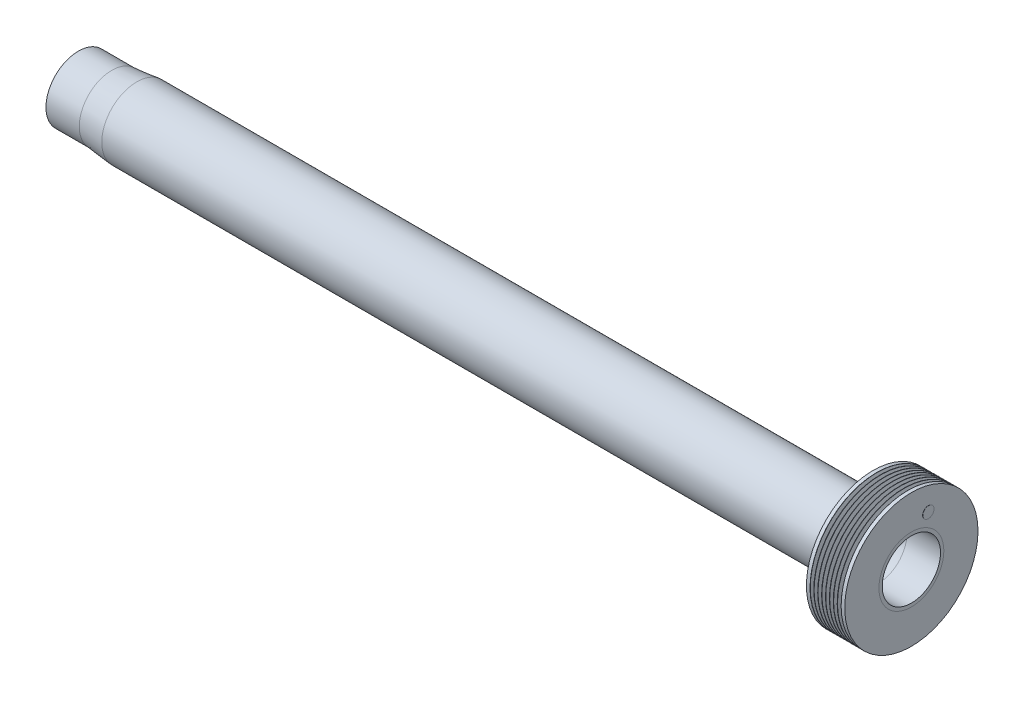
ISO-10303-21;
HEADER;
FILE_DESCRIPTION(('STEP AP214'),'2;1');
FILE_NAME('part.step','',(''),(''),'','','');
FILE_SCHEMA(('AUTOMOTIVE_DESIGN { 1 0 10303 214 1 1 1 1 }'));
ENDSEC;
DATA;
#1=APPLICATION_CONTEXT('core data for automotive mechanical design processes');
#2=APPLICATION_PROTOCOL_DEFINITION('international standard','automotive_design',2000,#1);
#3=PRODUCT_CONTEXT('',#1,'mechanical');
#4=PRODUCT('Part','Part','',(#3));
#5=PRODUCT_RELATED_PRODUCT_CATEGORY('part','',(#4));
#6=PRODUCT_DEFINITION_FORMATION('','',#4);
#7=PRODUCT_DEFINITION_CONTEXT('part definition',#1,'design');
#8=PRODUCT_DEFINITION('design','',#6,#7);
#9=PRODUCT_DEFINITION_SHAPE('','',#8);
#10=(LENGTH_UNIT() NAMED_UNIT(*) SI_UNIT(.MILLI.,.METRE.));
#11=(NAMED_UNIT(*) PLANE_ANGLE_UNIT() SI_UNIT($,.RADIAN.));
#12=(NAMED_UNIT(*) SI_UNIT($,.STERADIAN.) SOLID_ANGLE_UNIT());
#13=UNCERTAINTY_MEASURE_WITH_UNIT(LENGTH_MEASURE(1.E-05),#10,'distance_accuracy_value','');
#14=(GEOMETRIC_REPRESENTATION_CONTEXT(3) GLOBAL_UNCERTAINTY_ASSIGNED_CONTEXT((#13)) GLOBAL_UNIT_ASSIGNED_CONTEXT((#10,
#11,#12)) REPRESENTATION_CONTEXT('',''));
#15=CARTESIAN_POINT('',(0.,0.,0.));
#16=DIRECTION('',(0.,0.,1.));
#17=DIRECTION('',(1.,0.,0.));
#18=AXIS2_PLACEMENT_3D('',#15,#16,#17);
#19=CARTESIAN_POINT('',(238.593969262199,0.,0.));
#20=DIRECTION('',(-1.,0.,0.));
#21=DIRECTION('',(0.,-1.,0.));
#22=AXIS2_PLACEMENT_3D('',#19,#20,#21);
#23=CONICAL_SURFACE('',#22,39.9342020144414,1.2217304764);
#24=CARTESIAN_POINT('',(238.593969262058,0.,0.));
#25=DIRECTION('',(1.,0.,0.));
#26=DIRECTION('',(0.,-0.479425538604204,0.877582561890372));
#27=AXIS2_PLACEMENT_3D('',#24,#25,#26);
#28=CIRCLE('',#27,39.9342020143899);
#29=CARTESIAN_POINT('',(238.593969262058,-19.145476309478,35.045559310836));
#30=VERTEX_POINT('',#29);
#31=EDGE_CURVE('P0_E29',#30,#30,#28,.F.);
#32=ORIENTED_EDGE('',*,*,#31,.F.);
#33=EDGE_LOOP('',(#32));
#34=FACE_BOUND('',#33,.T.);
#35=CARTESIAN_POINT('',(239.482061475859,0.,0.));
#36=DIRECTION('',(1.,0.,0.));
#37=DIRECTION('',(0.,-0.479425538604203,0.877582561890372));
#38=AXIS2_PLACEMENT_3D('',#35,#36,#37);
#39=CIRCLE('',#38,37.4941887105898);
#40=CARTESIAN_POINT('',(239.482061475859,-17.9756716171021,32.9042461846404));
#41=VERTEX_POINT('',#40);
#42=EDGE_CURVE('P0_E256',#41,#41,#39,.F.);
#43=ORIENTED_EDGE('',*,*,#42,.T.);
#44=EDGE_LOOP('',(#43));
#45=FACE_BOUND('',#44,.T.);
#46=ADVANCED_FACE('P0_F14',(#34,#45),#23,.T.);
#47=CARTESIAN_POINT('',(238.5,0.,0.));
#48=DIRECTION('',(1.,0.,0.));
#49=DIRECTION('',(0.,-0.479425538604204,0.877582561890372));
#50=AXIS2_PLACEMENT_3D('',#47,#48,#49);
#51=TOROIDAL_SURFACE('',#50,39.9,0.1);
#52=CARTESIAN_POINT('',(238.406030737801,0.,0.));
#53=DIRECTION('',(1.,0.,0.));
#54=DIRECTION('',(0.,-0.479425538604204,0.877582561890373));
#55=AXIS2_PLACEMENT_3D('',#52,#53,#54);
#56=CIRCLE('',#55,39.9342020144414);
#57=CARTESIAN_POINT('',(238.406030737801,-19.1454763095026,35.0455593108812));
#58=VERTEX_POINT('',#57);
#59=EDGE_CURVE('P0_E243',#58,#58,#56,.F.);
#60=ORIENTED_EDGE('',*,*,#59,.F.);
#61=EDGE_LOOP('',(#60));
#62=FACE_BOUND('',#61,.T.);
#63=ORIENTED_EDGE('',*,*,#31,.T.);
#64=EDGE_LOOP('',(#63));
#65=FACE_BOUND('',#64,.T.);
#66=ADVANCED_FACE('P0_F251',(#62,#65),#51,.T.);
#67=CARTESIAN_POINT('',(239.67,0.,0.));
#68=DIRECTION('',(1.,0.,0.));
#69=DIRECTION('',(0.,-0.479425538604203,0.877582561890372));
#70=AXIS2_PLACEMENT_3D('',#67,#68,#69);
#71=TOROIDAL_SURFACE('',#70,37.5625927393,0.2);
#72=ORIENTED_EDGE('',*,*,#42,.F.);
#73=EDGE_LOOP('',(#72));
#74=FACE_BOUND('',#73,.T.);
#75=CARTESIAN_POINT('',(239.857938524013,0.,0.));
#76=DIRECTION('',(1.,0.,0.));
#77=DIRECTION('',(0.,-0.479425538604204,0.877582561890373));
#78=AXIS2_PLACEMENT_3D('',#75,#76,#77);
#79=CIRCLE('',#78,37.4941887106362);
#80=CARTESIAN_POINT('',(239.857938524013,-17.9756716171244,32.9042461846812));
#81=VERTEX_POINT('',#80);
#82=EDGE_CURVE('P0_E240',#81,#81,#79,.T.);
#83=ORIENTED_EDGE('',*,*,#82,.F.);
#84=EDGE_LOOP('',(#83));
#85=FACE_BOUND('',#84,.T.);
#86=ADVANCED_FACE('P0_F248',(#74,#85),#71,.F.);
#87=CARTESIAN_POINT('',(238.406030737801,0.,0.));
#88=DIRECTION('',(1.,0.,0.));
#89=DIRECTION('',(0.,1.,0.));
#90=AXIS2_PLACEMENT_3D('',#87,#88,#89);
#91=CONICAL_SURFACE('',#90,39.9342020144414,1.2217304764);
#92=CARTESIAN_POINT('',(237.517938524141,0.,0.));
#93=DIRECTION('',(1.,0.,0.));
#94=DIRECTION('',(0.,-0.479425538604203,0.877582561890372));
#95=AXIS2_PLACEMENT_3D('',#92,#93,#94);
#96=CIRCLE('',#95,37.4941887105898);
#97=CARTESIAN_POINT('',(237.517938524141,-17.9756716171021,32.9042461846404));
#98=VERTEX_POINT('',#97);
#99=EDGE_CURVE('P0_E237',#98,#98,#96,.T.);
#100=ORIENTED_EDGE('',*,*,#99,.T.);
#101=EDGE_LOOP('',(#100));
#102=FACE_BOUND('',#101,.T.);
#103=ORIENTED_EDGE('',*,*,#59,.T.);
#104=EDGE_LOOP('',(#103));
#105=FACE_BOUND('',#104,.T.);
#106=ADVANCED_FACE('P0_F250',(#102,#105),#91,.T.);
#107=CARTESIAN_POINT('',(240.746030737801,0.,0.));
#108=DIRECTION('',(1.,0.,0.));
#109=DIRECTION('',(0.,1.,0.));
#110=AXIS2_PLACEMENT_3D('',#107,#108,#109);
#111=CONICAL_SURFACE('',#110,39.9342020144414,1.2217304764);
#112=ORIENTED_EDGE('',*,*,#82,.T.);
#113=EDGE_LOOP('',(#112));
#114=FACE_BOUND('',#113,.T.);
#115=CARTESIAN_POINT('',(240.746030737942,0.,0.));
#116=DIRECTION('',(1.,0.,0.));
#117=DIRECTION('',(0.,-0.479425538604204,0.877582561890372));
#118=AXIS2_PLACEMENT_3D('',#115,#116,#117);
#119=CIRCLE('',#118,39.9342020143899);
#120=CARTESIAN_POINT('',(240.746030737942,-19.145476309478,35.045559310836));
#121=VERTEX_POINT('',#120);
#122=EDGE_CURVE('P0_E234',#121,#121,#119,.T.);
#123=ORIENTED_EDGE('',*,*,#122,.F.);
#124=EDGE_LOOP('',(#123));
#125=FACE_BOUND('',#124,.T.);
#126=ADVANCED_FACE('P0_F229',(#114,#125),#111,.T.);
#127=CARTESIAN_POINT('',(237.33,0.,0.));
#128=DIRECTION('',(1.,0.,0.));
#129=DIRECTION('',(0.,-0.479425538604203,0.877582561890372));
#130=AXIS2_PLACEMENT_3D('',#127,#128,#129);
#131=TOROIDAL_SURFACE('',#130,37.5625927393,0.2);
#132=CARTESIAN_POINT('',(237.142061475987,0.,0.));
#133=DIRECTION('',(-1.,0.,0.));
#134=DIRECTION('',(0.,-0.479425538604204,0.877582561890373));
#135=AXIS2_PLACEMENT_3D('',#132,#133,#134);
#136=CIRCLE('',#135,37.4941887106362);
#137=CARTESIAN_POINT('',(237.142061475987,-17.9756716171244,32.9042461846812));
#138=VERTEX_POINT('',#137);
#139=EDGE_CURVE('P0_E216',#138,#138,#136,.T.);
#140=ORIENTED_EDGE('',*,*,#139,.F.);
#141=EDGE_LOOP('',(#140));
#142=FACE_BOUND('',#141,.T.);
#143=ORIENTED_EDGE('',*,*,#99,.F.);
#144=EDGE_LOOP('',(#143));
#145=FACE_BOUND('',#144,.T.);
#146=ADVANCED_FACE('P0_F225',(#142,#145),#131,.F.);
#147=CARTESIAN_POINT('',(240.84,0.,0.));
#148=DIRECTION('',(1.,0.,0.));
#149=DIRECTION('',(0.,-0.479425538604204,0.877582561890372));
#150=AXIS2_PLACEMENT_3D('',#147,#148,#149);
#151=TOROIDAL_SURFACE('',#150,39.9,0.1);
#152=ORIENTED_EDGE('',*,*,#122,.T.);
#153=EDGE_LOOP('',(#152));
#154=FACE_BOUND('',#153,.T.);
#155=CARTESIAN_POINT('',(240.933969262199,0.,0.));
#156=DIRECTION('',(-1.,0.,0.));
#157=DIRECTION('',(0.,-0.479425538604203,0.877582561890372));
#158=AXIS2_PLACEMENT_3D('',#155,#156,#157);
#159=CIRCLE('',#158,39.9342020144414);
#160=CARTESIAN_POINT('',(240.933969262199,-19.1454763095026,35.0455593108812));
#161=VERTEX_POINT('',#160);
#162=EDGE_CURVE('P0_E213',#161,#161,#159,.F.);
#163=ORIENTED_EDGE('',*,*,#162,.F.);
#164=EDGE_LOOP('',(#163));
#165=FACE_BOUND('',#164,.T.);
#166=ADVANCED_FACE('P0_F221',(#154,#165),#151,.T.);
#167=CARTESIAN_POINT('',(236.253969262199,0.,0.));
#168=DIRECTION('',(-1.,0.,0.));
#169=DIRECTION('',(0.,-1.,0.));
#170=AXIS2_PLACEMENT_3D('',#167,#168,#169);
#171=CONICAL_SURFACE('',#170,39.9342020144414,1.2217304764);
#172=CARTESIAN_POINT('',(236.253969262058,0.,0.));
#173=DIRECTION('',(1.,0.,0.));
#174=DIRECTION('',(0.,-0.479425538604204,0.877582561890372));
#175=AXIS2_PLACEMENT_3D('',#172,#173,#174);
#176=CIRCLE('',#175,39.9342020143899);
#177=CARTESIAN_POINT('',(236.253969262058,-19.145476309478,35.045559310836));
#178=VERTEX_POINT('',#177);
#179=EDGE_CURVE('P0_E210',#178,#178,#176,.F.);
#180=ORIENTED_EDGE('',*,*,#179,.F.);
#181=EDGE_LOOP('',(#180));
#182=FACE_BOUND('',#181,.T.);
#183=ORIENTED_EDGE('',*,*,#139,.T.);
#184=EDGE_LOOP('',(#183));
#185=FACE_BOUND('',#184,.T.);
#186=ADVANCED_FACE('P0_F224',(#182,#185),#171,.T.);
#187=CARTESIAN_POINT('',(240.933969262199,0.,0.));
#188=DIRECTION('',(-1.,0.,0.));
#189=DIRECTION('',(0.,0.,1.));
#190=AXIS2_PLACEMENT_3D('',#187,#188,#189);
#191=CONICAL_SURFACE('',#190,39.9342020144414,1.2217304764);
#192=ORIENTED_EDGE('',*,*,#162,.T.);
#193=EDGE_LOOP('',(#192));
#194=FACE_BOUND('',#193,.T.);
#195=CARTESIAN_POINT('',(241.822061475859,0.,0.));
#196=DIRECTION('',(1.,0.,0.));
#197=DIRECTION('',(0.,-0.479425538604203,0.877582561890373));
#198=AXIS2_PLACEMENT_3D('',#195,#196,#197);
#199=CIRCLE('',#198,37.4941887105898);
#200=CARTESIAN_POINT('',(241.822061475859,-17.9756716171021,32.9042461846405));
#201=VERTEX_POINT('',#200);
#202=EDGE_CURVE('P0_E207',#201,#201,#199,.F.);
#203=ORIENTED_EDGE('',*,*,#202,.T.);
#204=EDGE_LOOP('',(#203));
#205=FACE_BOUND('',#204,.T.);
#206=ADVANCED_FACE('P0_F202',(#194,#205),#191,.T.);
#207=CARTESIAN_POINT('',(236.16,0.,0.));
#208=DIRECTION('',(1.,0.,0.));
#209=DIRECTION('',(0.,-0.479425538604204,0.877582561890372));
#210=AXIS2_PLACEMENT_3D('',#207,#208,#209);
#211=TOROIDAL_SURFACE('',#210,39.9,0.1);
#212=CARTESIAN_POINT('',(236.066030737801,0.,0.));
#213=DIRECTION('',(1.,0.,0.));
#214=DIRECTION('',(0.,-0.479425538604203,0.877582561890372));
#215=AXIS2_PLACEMENT_3D('',#212,#213,#214);
#216=CIRCLE('',#215,39.9342020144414);
#217=CARTESIAN_POINT('',(236.066030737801,-19.1454763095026,35.0455593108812));
#218=VERTEX_POINT('',#217);
#219=EDGE_CURVE('P0_E189',#218,#218,#216,.F.);
#220=ORIENTED_EDGE('',*,*,#219,.F.);
#221=EDGE_LOOP('',(#220));
#222=FACE_BOUND('',#221,.T.);
#223=ORIENTED_EDGE('',*,*,#179,.T.);
#224=EDGE_LOOP('',(#223));
#225=FACE_BOUND('',#224,.T.);
#226=ADVANCED_FACE('P0_F198',(#222,#225),#211,.T.);
#227=CARTESIAN_POINT('',(242.01,0.,0.));
#228=DIRECTION('',(1.,0.,0.));
#229=DIRECTION('',(0.,-0.479425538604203,0.877582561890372));
#230=AXIS2_PLACEMENT_3D('',#227,#228,#229);
#231=TOROIDAL_SURFACE('',#230,37.5625927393,0.2);
#232=ORIENTED_EDGE('',*,*,#202,.F.);
#233=EDGE_LOOP('',(#232));
#234=FACE_BOUND('',#233,.T.);
#235=CARTESIAN_POINT('',(242.197938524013,0.,0.));
#236=DIRECTION('',(1.,0.,0.));
#237=DIRECTION('',(0.,-0.479425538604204,0.877582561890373));
#238=AXIS2_PLACEMENT_3D('',#235,#236,#237);
#239=CIRCLE('',#238,37.4941887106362);
#240=CARTESIAN_POINT('',(242.197938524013,-17.9756716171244,32.9042461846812));
#241=VERTEX_POINT('',#240);
#242=EDGE_CURVE('P0_E186',#241,#241,#239,.T.);
#243=ORIENTED_EDGE('',*,*,#242,.F.);
#244=EDGE_LOOP('',(#243));
#245=FACE_BOUND('',#244,.T.);
#246=ADVANCED_FACE('P0_F194',(#234,#245),#231,.F.);
#247=CARTESIAN_POINT('',(236.066030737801,0.,0.));
#248=DIRECTION('',(1.,0.,0.));
#249=DIRECTION('',(0.,0.,-1.));
#250=AXIS2_PLACEMENT_3D('',#247,#248,#249);
#251=CONICAL_SURFACE('',#250,39.9342020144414,1.2217304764);
#252=CARTESIAN_POINT('',(235.177938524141,0.,0.));
#253=DIRECTION('',(1.,0.,0.));
#254=DIRECTION('',(0.,-0.479425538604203,0.877582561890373));
#255=AXIS2_PLACEMENT_3D('',#252,#253,#254);
#256=CIRCLE('',#255,37.4941887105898);
#257=CARTESIAN_POINT('',(235.177938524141,-17.9756716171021,32.9042461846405));
#258=VERTEX_POINT('',#257);
#259=EDGE_CURVE('P0_E183',#258,#258,#256,.T.);
#260=ORIENTED_EDGE('',*,*,#259,.T.);
#261=EDGE_LOOP('',(#260));
#262=FACE_BOUND('',#261,.T.);
#263=ORIENTED_EDGE('',*,*,#219,.T.);
#264=EDGE_LOOP('',(#263));
#265=FACE_BOUND('',#264,.T.);
#266=ADVANCED_FACE('P0_F197',(#262,#265),#251,.T.);
#267=CARTESIAN_POINT('',(243.086030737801,0.,0.));
#268=DIRECTION('',(1.,0.,0.));
#269=DIRECTION('',(0.,1.,0.));
#270=AXIS2_PLACEMENT_3D('',#267,#268,#269);
#271=CONICAL_SURFACE('',#270,39.9342020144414,1.2217304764);
#272=ORIENTED_EDGE('',*,*,#242,.T.);
#273=EDGE_LOOP('',(#272));
#274=FACE_BOUND('',#273,.T.);
#275=CARTESIAN_POINT('',(243.086030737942,0.,0.));
#276=DIRECTION('',(1.,0.,0.));
#277=DIRECTION('',(0.,-0.479425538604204,0.877582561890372));
#278=AXIS2_PLACEMENT_3D('',#275,#276,#277);
#279=CIRCLE('',#278,39.9342020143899);
#280=CARTESIAN_POINT('',(243.086030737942,-19.145476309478,35.045559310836));
#281=VERTEX_POINT('',#280);
#282=EDGE_CURVE('P0_E180',#281,#281,#279,.T.);
#283=ORIENTED_EDGE('',*,*,#282,.F.);
#284=EDGE_LOOP('',(#283));
#285=FACE_BOUND('',#284,.T.);
#286=ADVANCED_FACE('P0_F175',(#274,#285),#271,.T.);
#287=CARTESIAN_POINT('',(234.99,0.,0.));
#288=DIRECTION('',(1.,0.,0.));
#289=DIRECTION('',(0.,-0.479425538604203,0.877582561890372));
#290=AXIS2_PLACEMENT_3D('',#287,#288,#289);
#291=TOROIDAL_SURFACE('',#290,37.5625927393,0.2);
#292=CARTESIAN_POINT('',(234.802061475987,0.,0.));
#293=DIRECTION('',(-1.,0.,0.));
#294=DIRECTION('',(0.,-0.479425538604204,0.877582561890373));
#295=AXIS2_PLACEMENT_3D('',#292,#293,#294);
#296=CIRCLE('',#295,37.4941887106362);
#297=CARTESIAN_POINT('',(234.802061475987,-17.9756716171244,32.9042461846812));
#298=VERTEX_POINT('',#297);
#299=EDGE_CURVE('P0_E162',#298,#298,#296,.T.);
#300=ORIENTED_EDGE('',*,*,#299,.F.);
#301=EDGE_LOOP('',(#300));
#302=FACE_BOUND('',#301,.T.);
#303=ORIENTED_EDGE('',*,*,#259,.F.);
#304=EDGE_LOOP('',(#303));
#305=FACE_BOUND('',#304,.T.);
#306=ADVANCED_FACE('P0_F171',(#302,#305),#291,.F.);
#307=CARTESIAN_POINT('',(243.18,0.,0.));
#308=DIRECTION('',(1.,0.,0.));
#309=DIRECTION('',(0.,-0.479425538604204,0.877582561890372));
#310=AXIS2_PLACEMENT_3D('',#307,#308,#309);
#311=TOROIDAL_SURFACE('',#310,39.9,0.1);
#312=ORIENTED_EDGE('',*,*,#282,.T.);
#313=EDGE_LOOP('',(#312));
#314=FACE_BOUND('',#313,.T.);
#315=CARTESIAN_POINT('',(243.273969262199,0.,0.));
#316=DIRECTION('',(-1.,0.,0.));
#317=DIRECTION('',(0.,-0.479425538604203,0.877582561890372));
#318=AXIS2_PLACEMENT_3D('',#315,#316,#317);
#319=CIRCLE('',#318,39.9342020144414);
#320=CARTESIAN_POINT('',(243.273969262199,-19.1454763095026,35.0455593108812));
#321=VERTEX_POINT('',#320);
#322=EDGE_CURVE('P0_E159',#321,#321,#319,.F.);
#323=ORIENTED_EDGE('',*,*,#322,.F.);
#324=EDGE_LOOP('',(#323));
#325=FACE_BOUND('',#324,.T.);
#326=ADVANCED_FACE('P0_F167',(#314,#325),#311,.T.);
#327=CARTESIAN_POINT('',(233.913969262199,0.,0.));
#328=DIRECTION('',(-1.,0.,0.));
#329=DIRECTION('',(0.,-1.,0.));
#330=AXIS2_PLACEMENT_3D('',#327,#328,#329);
#331=CONICAL_SURFACE('',#330,39.9342020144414,1.2217304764);
#332=CARTESIAN_POINT('',(233.913969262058,0.,0.));
#333=DIRECTION('',(1.,0.,0.));
#334=DIRECTION('',(0.,-0.479425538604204,0.877582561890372));
#335=AXIS2_PLACEMENT_3D('',#332,#333,#334);
#336=CIRCLE('',#335,39.9342020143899);
#337=CARTESIAN_POINT('',(233.913969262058,-19.145476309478,35.045559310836));
#338=VERTEX_POINT('',#337);
#339=EDGE_CURVE('P0_E156',#338,#338,#336,.F.);
#340=ORIENTED_EDGE('',*,*,#339,.F.);
#341=EDGE_LOOP('',(#340));
#342=FACE_BOUND('',#341,.T.);
#343=ORIENTED_EDGE('',*,*,#299,.T.);
#344=EDGE_LOOP('',(#343));
#345=FACE_BOUND('',#344,.T.);
#346=ADVANCED_FACE('P0_F170',(#342,#345),#331,.T.);
#347=CARTESIAN_POINT('',(243.273969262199,0.,0.));
#348=DIRECTION('',(-1.,0.,0.));
#349=DIRECTION('',(0.,0.,1.));
#350=AXIS2_PLACEMENT_3D('',#347,#348,#349);
#351=CONICAL_SURFACE('',#350,39.9342020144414,1.2217304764);
#352=ORIENTED_EDGE('',*,*,#322,.T.);
#353=EDGE_LOOP('',(#352));
#354=FACE_BOUND('',#353,.T.);
#355=CARTESIAN_POINT('',(244.162061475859,0.,0.));
#356=DIRECTION('',(1.,0.,0.));
#357=DIRECTION('',(0.,-0.479425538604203,0.877582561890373));
#358=AXIS2_PLACEMENT_3D('',#355,#356,#357);
#359=CIRCLE('',#358,37.4941887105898);
#360=CARTESIAN_POINT('',(244.162061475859,-17.9756716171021,32.9042461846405));
#361=VERTEX_POINT('',#360);
#362=EDGE_CURVE('P0_E153',#361,#361,#359,.F.);
#363=ORIENTED_EDGE('',*,*,#362,.T.);
#364=EDGE_LOOP('',(#363));
#365=FACE_BOUND('',#364,.T.);
#366=ADVANCED_FACE('P0_F148',(#354,#365),#351,.T.);
#367=CARTESIAN_POINT('',(233.82,0.,0.));
#368=DIRECTION('',(1.,0.,0.));
#369=DIRECTION('',(0.,-0.479425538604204,0.877582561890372));
#370=AXIS2_PLACEMENT_3D('',#367,#368,#369);
#371=TOROIDAL_SURFACE('',#370,39.9,0.1);
#372=CARTESIAN_POINT('',(233.726030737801,0.,0.));
#373=DIRECTION('',(1.,0.,0.));
#374=DIRECTION('',(0.,-0.479425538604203,0.877582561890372));
#375=AXIS2_PLACEMENT_3D('',#372,#373,#374);
#376=CIRCLE('',#375,39.9342020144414);
#377=CARTESIAN_POINT('',(233.726030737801,-19.1454763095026,35.0455593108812));
#378=VERTEX_POINT('',#377);
#379=EDGE_CURVE('P0_E135',#378,#378,#376,.F.);
#380=ORIENTED_EDGE('',*,*,#379,.F.);
#381=EDGE_LOOP('',(#380));
#382=FACE_BOUND('',#381,.T.);
#383=ORIENTED_EDGE('',*,*,#339,.T.);
#384=EDGE_LOOP('',(#383));
#385=FACE_BOUND('',#384,.T.);
#386=ADVANCED_FACE('P0_F144',(#382,#385),#371,.T.);
#387=CARTESIAN_POINT('',(244.35,0.,0.));
#388=DIRECTION('',(1.,0.,0.));
#389=DIRECTION('',(0.,-0.479425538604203,0.877582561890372));
#390=AXIS2_PLACEMENT_3D('',#387,#388,#389);
#391=TOROIDAL_SURFACE('',#390,37.5625927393,0.2);
#392=ORIENTED_EDGE('',*,*,#362,.F.);
#393=EDGE_LOOP('',(#392));
#394=FACE_BOUND('',#393,.T.);
#395=CARTESIAN_POINT('',(244.537938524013,0.,0.));
#396=DIRECTION('',(1.,0.,0.));
#397=DIRECTION('',(0.,-0.479425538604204,0.877582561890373));
#398=AXIS2_PLACEMENT_3D('',#395,#396,#397);
#399=CIRCLE('',#398,37.4941887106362);
#400=CARTESIAN_POINT('',(244.537938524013,-17.9756716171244,32.9042461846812));
#401=VERTEX_POINT('',#400);
#402=EDGE_CURVE('P0_E132',#401,#401,#399,.T.);
#403=ORIENTED_EDGE('',*,*,#402,.F.);
#404=EDGE_LOOP('',(#403));
#405=FACE_BOUND('',#404,.T.);
#406=ADVANCED_FACE('P0_F140',(#394,#405),#391,.F.);
#407=CARTESIAN_POINT('',(233.726030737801,0.,0.));
#408=DIRECTION('',(1.,0.,0.));
#409=DIRECTION('',(0.,0.,-1.));
#410=AXIS2_PLACEMENT_3D('',#407,#408,#409);
#411=CONICAL_SURFACE('',#410,39.9342020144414,1.2217304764);
#412=CARTESIAN_POINT('',(232.837938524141,0.,0.));
#413=DIRECTION('',(1.,0.,0.));
#414=DIRECTION('',(0.,-0.479425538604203,0.877582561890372));
#415=AXIS2_PLACEMENT_3D('',#412,#413,#414);
#416=CIRCLE('',#415,37.4941887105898);
#417=CARTESIAN_POINT('',(232.837938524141,-17.9756716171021,32.9042461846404));
#418=VERTEX_POINT('',#417);
#419=EDGE_CURVE('P0_E129',#418,#418,#416,.T.);
#420=ORIENTED_EDGE('',*,*,#419,.T.);
#421=EDGE_LOOP('',(#420));
#422=FACE_BOUND('',#421,.T.);
#423=ORIENTED_EDGE('',*,*,#379,.T.);
#424=EDGE_LOOP('',(#423));
#425=FACE_BOUND('',#424,.T.);
#426=ADVANCED_FACE('P0_F143',(#422,#425),#411,.T.);
#427=CARTESIAN_POINT('',(245.426030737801,0.,0.));
#428=DIRECTION('',(1.,0.,0.));
#429=DIRECTION('',(0.,1.,0.));
#430=AXIS2_PLACEMENT_3D('',#427,#428,#429);
#431=CONICAL_SURFACE('',#430,39.9342020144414,1.2217304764);
#432=ORIENTED_EDGE('',*,*,#402,.T.);
#433=EDGE_LOOP('',(#432));
#434=FACE_BOUND('',#433,.T.);
#435=CARTESIAN_POINT('',(245.426030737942,0.,0.));
#436=DIRECTION('',(1.,0.,0.));
#437=DIRECTION('',(0.,-0.479425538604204,0.877582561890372));
#438=AXIS2_PLACEMENT_3D('',#435,#436,#437);
#439=CIRCLE('',#438,39.9342020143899);
#440=CARTESIAN_POINT('',(245.426030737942,-19.145476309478,35.045559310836));
#441=VERTEX_POINT('',#440);
#442=EDGE_CURVE('P0_E126',#441,#441,#439,.T.);
#443=ORIENTED_EDGE('',*,*,#442,.F.);
#444=EDGE_LOOP('',(#443));
#445=FACE_BOUND('',#444,.T.);
#446=ADVANCED_FACE('P0_F121',(#434,#445),#431,.T.);
#447=CARTESIAN_POINT('',(232.65,0.,0.));
#448=DIRECTION('',(1.,0.,0.));
#449=DIRECTION('',(0.,-0.479425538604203,0.877582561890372));
#450=AXIS2_PLACEMENT_3D('',#447,#448,#449);
#451=TOROIDAL_SURFACE('',#450,37.5625927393,0.2);
#452=CARTESIAN_POINT('',(232.462061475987,0.,0.));
#453=DIRECTION('',(-1.,0.,0.));
#454=DIRECTION('',(0.,-0.479425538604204,0.877582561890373));
#455=AXIS2_PLACEMENT_3D('',#452,#453,#454);
#456=CIRCLE('',#455,37.4941887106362);
#457=CARTESIAN_POINT('',(232.462061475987,-17.9756716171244,32.9042461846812));
#458=VERTEX_POINT('',#457);
#459=EDGE_CURVE('P0_E108',#458,#458,#456,.T.);
#460=ORIENTED_EDGE('',*,*,#459,.F.);
#461=EDGE_LOOP('',(#460));
#462=FACE_BOUND('',#461,.T.);
#463=ORIENTED_EDGE('',*,*,#419,.F.);
#464=EDGE_LOOP('',(#463));
#465=FACE_BOUND('',#464,.T.);
#466=ADVANCED_FACE('P0_F117',(#462,#465),#451,.F.);
#467=CARTESIAN_POINT('',(245.52,0.,0.));
#468=DIRECTION('',(1.,0.,0.));
#469=DIRECTION('',(0.,-0.479425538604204,0.877582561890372));
#470=AXIS2_PLACEMENT_3D('',#467,#468,#469);
#471=TOROIDAL_SURFACE('',#470,39.9,0.1);
#472=ORIENTED_EDGE('',*,*,#442,.T.);
#473=EDGE_LOOP('',(#472));
#474=FACE_BOUND('',#473,.T.);
#475=CARTESIAN_POINT('',(245.613969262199,0.,0.));
#476=DIRECTION('',(-1.,0.,0.));
#477=DIRECTION('',(0.,-0.479425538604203,0.877582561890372));
#478=AXIS2_PLACEMENT_3D('',#475,#476,#477);
#479=CIRCLE('',#478,39.9342020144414);
#480=CARTESIAN_POINT('',(245.613969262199,-19.1454763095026,35.0455593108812));
#481=VERTEX_POINT('',#480);
#482=EDGE_CURVE('P0_E105',#481,#481,#479,.F.);
#483=ORIENTED_EDGE('',*,*,#482,.F.);
#484=EDGE_LOOP('',(#483));
#485=FACE_BOUND('',#484,.T.);
#486=ADVANCED_FACE('P0_F113',(#474,#485),#471,.T.);
#487=CARTESIAN_POINT('',(231.573969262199,0.,0.));
#488=DIRECTION('',(-1.,0.,0.));
#489=DIRECTION('',(0.,-1.,0.));
#490=AXIS2_PLACEMENT_3D('',#487,#488,#489);
#491=CONICAL_SURFACE('',#490,39.9342020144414,1.2217304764);
#492=CARTESIAN_POINT('',(231.573969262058,0.,0.));
#493=DIRECTION('',(1.,0.,0.));
#494=DIRECTION('',(0.,-0.479425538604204,0.877582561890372));
#495=AXIS2_PLACEMENT_3D('',#492,#493,#494);
#496=CIRCLE('',#495,39.9342020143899);
#497=CARTESIAN_POINT('',(231.573969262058,-19.145476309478,35.045559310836));
#498=VERTEX_POINT('',#497);
#499=EDGE_CURVE('P0_E102',#498,#498,#496,.F.);
#500=ORIENTED_EDGE('',*,*,#499,.F.);
#501=EDGE_LOOP('',(#500));
#502=FACE_BOUND('',#501,.T.);
#503=ORIENTED_EDGE('',*,*,#459,.T.);
#504=EDGE_LOOP('',(#503));
#505=FACE_BOUND('',#504,.T.);
#506=ADVANCED_FACE('P0_F116',(#502,#505),#491,.T.);
#507=CARTESIAN_POINT('',(245.613969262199,0.,0.));
#508=DIRECTION('',(-1.,0.,0.));
#509=DIRECTION('',(0.,0.,1.));
#510=AXIS2_PLACEMENT_3D('',#507,#508,#509);
#511=CONICAL_SURFACE('',#510,39.9342020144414,1.2217304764);
#512=ORIENTED_EDGE('',*,*,#482,.T.);
#513=EDGE_LOOP('',(#512));
#514=FACE_BOUND('',#513,.T.);
#515=CARTESIAN_POINT('',(246.502061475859,0.,0.));
#516=DIRECTION('',(1.,0.,0.));
#517=DIRECTION('',(0.,-0.479425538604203,0.877582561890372));
#518=AXIS2_PLACEMENT_3D('',#515,#516,#517);
#519=CIRCLE('',#518,37.4941887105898);
#520=CARTESIAN_POINT('',(246.502061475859,-17.9756716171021,32.9042461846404));
#521=VERTEX_POINT('',#520);
#522=EDGE_CURVE('P0_E99',#521,#521,#519,.F.);
#523=ORIENTED_EDGE('',*,*,#522,.T.);
#524=EDGE_LOOP('',(#523));
#525=FACE_BOUND('',#524,.T.);
#526=ADVANCED_FACE('P0_F94',(#514,#525),#511,.T.);
#527=CARTESIAN_POINT('',(231.48,0.,0.));
#528=DIRECTION('',(1.,0.,0.));
#529=DIRECTION('',(0.,-0.479425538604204,0.877582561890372));
#530=AXIS2_PLACEMENT_3D('',#527,#528,#529);
#531=TOROIDAL_SURFACE('',#530,39.9,0.1);
#532=CARTESIAN_POINT('',(231.386030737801,0.,0.));
#533=DIRECTION('',(1.,0.,0.));
#534=DIRECTION('',(0.,-0.479425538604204,0.877582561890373));
#535=AXIS2_PLACEMENT_3D('',#532,#533,#534);
#536=CIRCLE('',#535,39.9342020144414);
#537=CARTESIAN_POINT('',(231.386030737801,-19.1454763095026,35.0455593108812));
#538=VERTEX_POINT('',#537);
#539=EDGE_CURVE('P0_E81',#538,#538,#536,.F.);
#540=ORIENTED_EDGE('',*,*,#539,.F.);
#541=EDGE_LOOP('',(#540));
#542=FACE_BOUND('',#541,.T.);
#543=ORIENTED_EDGE('',*,*,#499,.T.);
#544=EDGE_LOOP('',(#543));
#545=FACE_BOUND('',#544,.T.);
#546=ADVANCED_FACE('P0_F90',(#542,#545),#531,.T.);
#547=CARTESIAN_POINT('',(246.69,0.,0.));
#548=DIRECTION('',(1.,0.,0.));
#549=DIRECTION('',(0.,-0.479425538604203,0.877582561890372));
#550=AXIS2_PLACEMENT_3D('',#547,#548,#549);
#551=TOROIDAL_SURFACE('',#550,37.5625927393,0.2);
#552=ORIENTED_EDGE('',*,*,#522,.F.);
#553=EDGE_LOOP('',(#552));
#554=FACE_BOUND('',#553,.T.);
#555=CARTESIAN_POINT('',(246.877938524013,0.,0.));
#556=DIRECTION('',(1.,0.,0.));
#557=DIRECTION('',(0.,-0.479425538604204,0.877582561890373));
#558=AXIS2_PLACEMENT_3D('',#555,#556,#557);
#559=CIRCLE('',#558,37.4941887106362);
#560=CARTESIAN_POINT('',(246.877938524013,-17.9756716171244,32.9042461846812));
#561=VERTEX_POINT('',#560);
#562=EDGE_CURVE('P0_E78',#561,#561,#559,.T.);
#563=ORIENTED_EDGE('',*,*,#562,.F.);
#564=EDGE_LOOP('',(#563));
#565=FACE_BOUND('',#564,.T.);
#566=ADVANCED_FACE('P0_F86',(#554,#565),#551,.F.);
#567=CARTESIAN_POINT('',(231.386030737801,0.,0.));
#568=DIRECTION('',(1.,0.,0.));
#569=DIRECTION('',(0.,1.,0.));
#570=AXIS2_PLACEMENT_3D('',#567,#568,#569);
#571=CONICAL_SURFACE('',#570,39.9342020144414,1.2217304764);
#572=CARTESIAN_POINT('',(230.497938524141,0.,0.));
#573=DIRECTION('',(1.,0.,0.));
#574=DIRECTION('',(0.,-0.479425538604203,0.877582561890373));
#575=AXIS2_PLACEMENT_3D('',#572,#573,#574);
#576=CIRCLE('',#575,37.4941887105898);
#577=CARTESIAN_POINT('',(230.497938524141,-17.9756716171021,32.9042461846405));
#578=VERTEX_POINT('',#577);
#579=EDGE_CURVE('P0_E75',#578,#578,#576,.T.);
#580=ORIENTED_EDGE('',*,*,#579,.T.);
#581=EDGE_LOOP('',(#580));
#582=FACE_BOUND('',#581,.T.);
#583=ORIENTED_EDGE('',*,*,#539,.T.);
#584=EDGE_LOOP('',(#583));
#585=FACE_BOUND('',#584,.T.);
#586=ADVANCED_FACE('P0_F89',(#582,#585),#571,.T.);
#587=CARTESIAN_POINT('',(247.766030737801,0.,0.));
#588=DIRECTION('',(1.,0.,0.));
#589=DIRECTION('',(0.,1.,0.));
#590=AXIS2_PLACEMENT_3D('',#587,#588,#589);
#591=CONICAL_SURFACE('',#590,39.9342020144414,1.2217304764);
#592=ORIENTED_EDGE('',*,*,#562,.T.);
#593=EDGE_LOOP('',(#592));
#594=FACE_BOUND('',#593,.T.);
#595=CARTESIAN_POINT('',(247.766030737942,0.,0.));
#596=DIRECTION('',(1.,0.,0.));
#597=DIRECTION('',(0.,-0.479425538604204,0.877582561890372));
#598=AXIS2_PLACEMENT_3D('',#595,#596,#597);
#599=CIRCLE('',#598,39.9342020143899);
#600=CARTESIAN_POINT('',(247.766030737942,-19.145476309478,35.045559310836));
#601=VERTEX_POINT('',#600);
#602=EDGE_CURVE('P0_E72',#601,#601,#599,.T.);
#603=ORIENTED_EDGE('',*,*,#602,.F.);
#604=EDGE_LOOP('',(#603));
#605=FACE_BOUND('',#604,.T.);
#606=ADVANCED_FACE('P0_F66',(#594,#605),#591,.T.);
#607=CARTESIAN_POINT('',(230.31,0.,0.));
#608=DIRECTION('',(1.,0.,0.));
#609=DIRECTION('',(0.,-0.479425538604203,0.877582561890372));
#610=AXIS2_PLACEMENT_3D('',#607,#608,#609);
#611=TOROIDAL_SURFACE('',#610,37.5625927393,0.2);
#612=CARTESIAN_POINT('',(230.122061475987,0.,0.));
#613=DIRECTION('',(-1.,0.,0.));
#614=DIRECTION('',(0.,-0.479425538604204,0.877582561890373));
#615=AXIS2_PLACEMENT_3D('',#612,#613,#614);
#616=CIRCLE('',#615,37.4941887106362);
#617=CARTESIAN_POINT('',(230.122061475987,-17.9756716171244,32.9042461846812));
#618=VERTEX_POINT('',#617);
#619=EDGE_CURVE('P0_E71',#618,#618,#616,.T.);
#620=ORIENTED_EDGE('',*,*,#619,.F.);
#621=EDGE_LOOP('',(#620));
#622=FACE_BOUND('',#621,.T.);
#623=ORIENTED_EDGE('',*,*,#579,.F.);
#624=EDGE_LOOP('',(#623));
#625=FACE_BOUND('',#624,.T.);
#626=ADVANCED_FACE('P0_F60',(#622,#625),#611,.F.);
#627=CARTESIAN_POINT('',(247.86,0.,0.));
#628=DIRECTION('',(1.,0.,0.));
#629=DIRECTION('',(0.,-0.479425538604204,0.877582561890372));
#630=AXIS2_PLACEMENT_3D('',#627,#628,#629);
#631=TOROIDAL_SURFACE('',#630,39.9,0.1);
#632=ORIENTED_EDGE('',*,*,#602,.T.);
#633=EDGE_LOOP('',(#632));
#634=FACE_BOUND('',#633,.T.);
#635=CARTESIAN_POINT('',(247.86,0.,0.));
#636=DIRECTION('',(1.,0.,0.));
#637=DIRECTION('',(0.,0.,-1.));
#638=AXIS2_PLACEMENT_3D('',#635,#636,#637);
#639=CIRCLE('',#638,40.);
#640=CARTESIAN_POINT('',(247.86,0.,-40.));
#641=VERTEX_POINT('',#640);
#642=EDGE_CURVE('P0_E47',#641,#641,#639,.T.);
#643=ORIENTED_EDGE('',*,*,#642,.F.);
#644=EDGE_LOOP('',(#643));
#645=FACE_BOUND('',#644,.T.);
#646=ADVANCED_FACE('P0_F55',(#634,#645),#631,.T.);
#647=CARTESIAN_POINT('',(250.1,0.,0.));
#648=DIRECTION('',(1.,0.,0.));
#649=DIRECTION('',(0.,0.,-1.));
#650=AXIS2_PLACEMENT_3D('',#647,#648,#649);
#651=PLANE('',#650);
#652=CARTESIAN_POINT('',(250.1,24.7655034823,-10.1505822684));
#653=DIRECTION('',(1.,0.,0.));
#654=DIRECTION('',(0.,0.,-1.));
#655=AXIS2_PLACEMENT_3D('',#652,#653,#654);
#656=CIRCLE('',#655,3.36953521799);
#657=CARTESIAN_POINT('',(250.1,24.7655034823,-13.52011748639));
#658=VERTEX_POINT('',#657);
#659=EDGE_CURVE('P0_E17',#658,#658,#656,.F.);
#660=ORIENTED_EDGE('',*,*,#659,.F.);
#661=EDGE_LOOP('',(#660));
#662=FACE_BOUND('',#661,.T.);
#663=ADVANCED_FACE('P0_F59',(#662),#651,.T.);
#664=CARTESIAN_POINT('',(229.233969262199,0.,0.));
#665=DIRECTION('',(-1.,0.,0.));
#666=DIRECTION('',(0.,-1.,0.));
#667=AXIS2_PLACEMENT_3D('',#664,#665,#666);
#668=CONICAL_SURFACE('',#667,39.9342020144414,1.2217304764);
#669=CARTESIAN_POINT('',(229.233969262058,0.,0.));
#670=DIRECTION('',(1.,0.,0.));
#671=DIRECTION('',(0.,-0.479425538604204,0.877582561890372));
#672=AXIS2_PLACEMENT_3D('',#669,#670,#671);
#673=CIRCLE('',#672,39.9342020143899);
#674=CARTESIAN_POINT('',(229.233969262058,-19.145476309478,35.045559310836));
#675=VERTEX_POINT('',#674);
#676=EDGE_CURVE('P0_E39',#675,#675,#673,.F.);
#677=ORIENTED_EDGE('',*,*,#676,.F.);
#678=EDGE_LOOP('',(#677));
#679=FACE_BOUND('',#678,.T.);
#680=ORIENTED_EDGE('',*,*,#619,.T.);
#681=EDGE_LOOP('',(#680));
#682=FACE_BOUND('',#681,.T.);
#683=ADVANCED_FACE('P0_F301',(#679,#682),#668,.T.);
#684=CARTESIAN_POINT('',(238.5,0.,0.));
#685=DIRECTION('',(1.,0.,0.));
#686=DIRECTION('',(0.,0.,-1.));
#687=AXIS2_PLACEMENT_3D('',#684,#685,#686);
#688=CYLINDRICAL_SURFACE('',#687,40.);
#689=CARTESIAN_POINT('',(250.,0.,0.));
#690=DIRECTION('',(1.,0.,0.));
#691=DIRECTION('',(0.,0.,-1.));
#692=AXIS2_PLACEMENT_3D('',#689,#690,#691);
#693=CIRCLE('',#692,40.);
#694=CARTESIAN_POINT('',(250.,0.,-40.));
#695=VERTEX_POINT('',#694);
#696=EDGE_CURVE('P0_E37',#695,#695,#693,.T.);
#697=ORIENTED_EDGE('',*,*,#696,.F.);
#698=EDGE_LOOP('',(#697));
#699=FACE_BOUND('',#698,.T.);
#700=ORIENTED_EDGE('',*,*,#642,.T.);
#701=EDGE_LOOP('',(#700));
#702=FACE_BOUND('',#701,.T.);
#703=ADVANCED_FACE('P0_F298',(#699,#702),#688,.T.);
#704=CARTESIAN_POINT('',(250.05,24.7655034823,-10.1505822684));
#705=DIRECTION('',(1.,0.,0.));
#706=DIRECTION('',(0.,0.,-1.));
#707=AXIS2_PLACEMENT_3D('',#704,#705,#706);
#708=CYLINDRICAL_SURFACE('',#707,3.36953521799);
#709=CARTESIAN_POINT('',(250.,24.7655034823,-10.1505822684));
#710=DIRECTION('',(1.,0.,0.));
#711=DIRECTION('',(0.,0.,-1.));
#712=AXIS2_PLACEMENT_3D('',#709,#710,#711);
#713=CIRCLE('',#712,3.36953521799);
#714=CARTESIAN_POINT('',(250.,24.7655034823,-13.52011748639));
#715=VERTEX_POINT('',#714);
#716=EDGE_CURVE('P0_E35',#715,#715,#713,.F.);
#717=ORIENTED_EDGE('',*,*,#716,.F.);
#718=EDGE_LOOP('',(#717));
#719=FACE_BOUND('',#718,.T.);
#720=ORIENTED_EDGE('',*,*,#659,.T.);
#721=EDGE_LOOP('',(#720));
#722=FACE_BOUND('',#721,.T.);
#723=ADVANCED_FACE('P0_F293',(#719,#722),#708,.T.);
#724=CARTESIAN_POINT('',(229.14,0.,0.));
#725=DIRECTION('',(1.,0.,0.));
#726=DIRECTION('',(0.,-0.479425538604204,0.877582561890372));
#727=AXIS2_PLACEMENT_3D('',#724,#725,#726);
#728=TOROIDAL_SURFACE('',#727,39.9,0.1);
#729=CARTESIAN_POINT('',(229.14,0.,0.));
#730=DIRECTION('',(1.,0.,0.));
#731=DIRECTION('',(0.,0.,-1.));
#732=AXIS2_PLACEMENT_3D('',#729,#730,#731);
#733=CIRCLE('',#732,40.);
#734=CARTESIAN_POINT('',(229.14,0.,-40.));
#735=VERTEX_POINT('',#734);
#736=EDGE_CURVE('P0_E34',#735,#735,#733,.F.);
#737=ORIENTED_EDGE('',*,*,#736,.F.);
#738=EDGE_LOOP('',(#737));
#739=FACE_BOUND('',#738,.T.);
#740=ORIENTED_EDGE('',*,*,#676,.T.);
#741=EDGE_LOOP('',(#740));
#742=FACE_BOUND('',#741,.T.);
#743=ADVANCED_FACE('P0_F289',(#739,#742),#728,.T.);
#744=CARTESIAN_POINT('',(250.,0.,0.));
#745=DIRECTION('',(1.,0.,0.));
#746=DIRECTION('',(0.,0.,-1.));
#747=AXIS2_PLACEMENT_3D('',#744,#745,#746);
#748=PLANE('',#747);
#749=CARTESIAN_POINT('',(250.,0.,0.));
#750=DIRECTION('',(1.,0.,0.));
#751=DIRECTION('',(0.,0.,-1.));
#752=AXIS2_PLACEMENT_3D('',#749,#750,#751);
#753=CIRCLE('',#752,19.5);
#754=CARTESIAN_POINT('',(250.,0.,-19.5));
#755=VERTEX_POINT('',#754);
#756=EDGE_CURVE('P0_E26',#755,#755,#753,.F.);
#757=ORIENTED_EDGE('',*,*,#756,.T.);
#758=EDGE_LOOP('',(#757));
#759=FACE_BOUND('',#758,.T.);
#760=ORIENTED_EDGE('',*,*,#716,.T.);
#761=EDGE_LOOP('',(#760));
#762=FACE_BOUND('',#761,.T.);
#763=ORIENTED_EDGE('',*,*,#696,.T.);
#764=EDGE_LOOP('',(#763));
#765=FACE_BOUND('',#764,.T.);
#766=ADVANCED_FACE('P0_F285',(#759,#762,#765),#748,.T.);
#767=CARTESIAN_POINT('',(238.5,0.,0.));
#768=DIRECTION('',(1.,0.,0.));
#769=DIRECTION('',(0.,0.,-1.));
#770=AXIS2_PLACEMENT_3D('',#767,#768,#769);
#771=CYLINDRICAL_SURFACE('',#770,40.);
#772=CARTESIAN_POINT('',(227.,0.,0.));
#773=DIRECTION('',(1.,0.,0.));
#774=DIRECTION('',(0.,0.,-1.));
#775=AXIS2_PLACEMENT_3D('',#772,#773,#774);
#776=CIRCLE('',#775,40.);
#777=CARTESIAN_POINT('',(227.,0.,-40.));
#778=VERTEX_POINT('',#777);
#779=EDGE_CURVE('P0_E21',#778,#778,#776,.T.);
#780=ORIENTED_EDGE('',*,*,#779,.T.);
#781=EDGE_LOOP('',(#780));
#782=FACE_BOUND('',#781,.T.);
#783=ORIENTED_EDGE('',*,*,#736,.T.);
#784=EDGE_LOOP('',(#783));
#785=FACE_BOUND('',#784,.T.);
#786=ADVANCED_FACE('P0_F278',(#782,#785),#771,.T.);
#787=CARTESIAN_POINT('',(238.5,0.,0.));
#788=DIRECTION('',(1.,0.,0.));
#789=DIRECTION('',(0.,0.,-1.));
#790=AXIS2_PLACEMENT_3D('',#787,#788,#789);
#791=CYLINDRICAL_SURFACE('',#790,19.5);
#792=ORIENTED_EDGE('',*,*,#756,.F.);
#793=EDGE_LOOP('',(#792));
#794=FACE_BOUND('',#793,.T.);
#795=CARTESIAN_POINT('',(227.,0.,0.));
#796=DIRECTION('',(1.,0.,0.));
#797=DIRECTION('',(0.,0.,-1.));
#798=AXIS2_PLACEMENT_3D('',#795,#796,#797);
#799=CIRCLE('',#798,19.5);
#800=CARTESIAN_POINT('',(227.,0.,-19.5));
#801=VERTEX_POINT('',#800);
#802=EDGE_CURVE('P0_E10',#801,#801,#799,.F.);
#803=ORIENTED_EDGE('',*,*,#802,.T.);
#804=EDGE_LOOP('',(#803));
#805=FACE_BOUND('',#804,.T.);
#806=ADVANCED_FACE('P0_F271',(#794,#805),#791,.F.);
#807=CARTESIAN_POINT('',(227.,0.,0.));
#808=DIRECTION('',(1.,0.,0.));
#809=DIRECTION('',(0.,0.,-1.));
#810=AXIS2_PLACEMENT_3D('',#807,#808,#809);
#811=PLANE('',#810);
#812=ORIENTED_EDGE('',*,*,#802,.F.);
#813=EDGE_LOOP('',(#812));
#814=FACE_BOUND('',#813,.T.);
#815=ORIENTED_EDGE('',*,*,#779,.F.);
#816=EDGE_LOOP('',(#815));
#817=FACE_BOUND('',#816,.T.);
#818=ADVANCED_FACE('P0_F269',(#814,#817),#811,.F.);
#819=CLOSED_SHELL('',(#46,#66,#86,#106,#126,#146,#166,#186,#206,#226,#246,#266,#286,#306,#326,
#346,#366,#386,#406,#426,#446,#466,#486,#506,#526,#546,#566,#586,#606,#626,#646,#663,#683,#703,
#723,#743,#766,#786,#806,#818));
#820=MANIFOLD_SOLID_BREP('P0_B1',#819);
#821=CARTESIAN_POINT('',(-125.,0.,0.));
#822=DIRECTION('',(1.,0.,0.));
#823=DIRECTION('',(0.,0.,-1.));
#824=AXIS2_PLACEMENT_3D('',#821,#822,#823);
#825=CYLINDRICAL_SURFACE('',#824,19.);
#826=CARTESIAN_POINT('',(-214.900248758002,0.,0.));
#827=DIRECTION('',(1.,0.,0.));
#828=DIRECTION('',(0.,-0.479425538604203,0.877582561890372));
#829=AXIS2_PLACEMENT_3D('',#826,#827,#828);
#830=CIRCLE('',#829,19.0000000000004);
#831=CARTESIAN_POINT('',(-214.900248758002,-9.10908523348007,16.6740686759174));
#832=VERTEX_POINT('',#831);
#833=EDGE_CURVE('P1_E44',#832,#832,#830,.F.);
#834=ORIENTED_EDGE('',*,*,#833,.T.);
#835=EDGE_LOOP('',(#834));
#836=FACE_BOUND('',#835,.T.);
#837=CARTESIAN_POINT('',(214.900248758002,0.,0.));
#838=DIRECTION('',(-1.,0.,0.));
#839=DIRECTION('',(0.,-0.479425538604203,0.877582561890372));
#840=AXIS2_PLACEMENT_3D('',#837,#838,#839);
#841=CIRCLE('',#840,19.0000000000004);
#842=CARTESIAN_POINT('',(214.900248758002,-9.10908523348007,16.6740686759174));
#843=VERTEX_POINT('',#842);
#844=EDGE_CURVE('P1_E41',#843,#843,#841,.F.);
#845=ORIENTED_EDGE('',*,*,#844,.T.);
#846=EDGE_LOOP('',(#845));
#847=FACE_BOUND('',#846,.T.);
#848=ADVANCED_FACE('P1_F14',(#836,#847),#825,.F.);
#849=CARTESIAN_POINT('',(-214.900248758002,0.,0.));
#850=DIRECTION('',(1.,0.,0.));
#851=DIRECTION('',(0.,1.,0.));
#852=AXIS2_PLACEMENT_3D('',#849,#850,#851);
#853=CONICAL_SURFACE('',#852,19.0000000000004,0.0996686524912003);
#854=CARTESIAN_POINT('',(-229.900248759,0.,0.));
#855=DIRECTION('',(1.,0.,0.));
#856=DIRECTION('',(0.,0.,-1.));
#857=AXIS2_PLACEMENT_3D('',#854,#855,#856);
#858=CIRCLE('',#857,17.5);
#859=CARTESIAN_POINT('',(-229.900248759,0.,-17.5));
#860=VERTEX_POINT('',#859);
#861=EDGE_CURVE('P1_E38',#860,#860,#858,.F.);
#862=ORIENTED_EDGE('',*,*,#861,.T.);
#863=EDGE_LOOP('',(#862));
#864=FACE_BOUND('',#863,.T.);
#865=ORIENTED_EDGE('',*,*,#833,.F.);
#866=EDGE_LOOP('',(#865));
#867=FACE_BOUND('',#866,.T.);
#868=ADVANCED_FACE('P1_F105',(#864,#867),#853,.F.);
#869=CARTESIAN_POINT('',(214.900248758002,0.,0.));
#870=DIRECTION('',(-1.,0.,0.));
#871=DIRECTION('',(0.,-1.,0.));
#872=AXIS2_PLACEMENT_3D('',#869,#870,#871);
#873=CONICAL_SURFACE('',#872,19.0000000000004,0.0996686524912);
#874=CARTESIAN_POINT('',(229.900248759,0.,0.));
#875=DIRECTION('',(1.,0.,0.));
#876=DIRECTION('',(0.,0.,-1.));
#877=AXIS2_PLACEMENT_3D('',#874,#875,#876);
#878=CIRCLE('',#877,17.5);
#879=CARTESIAN_POINT('',(229.900248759,0.,-17.5));
#880=VERTEX_POINT('',#879);
#881=EDGE_CURVE('P1_E35',#880,#880,#878,.T.);
#882=ORIENTED_EDGE('',*,*,#881,.T.);
#883=EDGE_LOOP('',(#882));
#884=FACE_BOUND('',#883,.T.);
#885=ORIENTED_EDGE('',*,*,#844,.F.);
#886=EDGE_LOOP('',(#885));
#887=FACE_BOUND('',#886,.T.);
#888=ADVANCED_FACE('P1_F103',(#884,#887),#873,.F.);
#889=CARTESIAN_POINT('',(-125.,0.,0.));
#890=DIRECTION('',(1.,0.,0.));
#891=DIRECTION('',(0.,0.,-1.));
#892=AXIS2_PLACEMENT_3D('',#889,#890,#891);
#893=CYLINDRICAL_SURFACE('',#892,17.5);
#894=CARTESIAN_POINT('',(-250.,0.,0.));
#895=DIRECTION('',(1.,0.,0.));
#896=DIRECTION('',(0.,0.,-1.));
#897=AXIS2_PLACEMENT_3D('',#894,#895,#896);
#898=CIRCLE('',#897,17.5);
#899=CARTESIAN_POINT('',(-250.,0.,-17.5));
#900=VERTEX_POINT('',#899);
#901=EDGE_CURVE('P1_E17',#900,#900,#898,.F.);
#902=ORIENTED_EDGE('',*,*,#901,.T.);
#903=EDGE_LOOP('',(#902));
#904=FACE_BOUND('',#903,.T.);
#905=ORIENTED_EDGE('',*,*,#861,.F.);
#906=EDGE_LOOP('',(#905));
#907=FACE_BOUND('',#906,.T.);
#908=ADVANCED_FACE('P1_F58',(#904,#907),#893,.F.);
#909=CARTESIAN_POINT('',(-125.,0.,0.));
#910=DIRECTION('',(1.,0.,0.));
#911=DIRECTION('',(0.,0.,-1.));
#912=AXIS2_PLACEMENT_3D('',#909,#910,#911);
#913=CYLINDRICAL_SURFACE('',#912,17.5);
#914=CARTESIAN_POINT('',(250.,0.,0.));
#915=DIRECTION('',(1.,0.,0.));
#916=DIRECTION('',(0.,0.,-1.));
#917=AXIS2_PLACEMENT_3D('',#914,#915,#916);
#918=CIRCLE('',#917,17.5);
#919=CARTESIAN_POINT('',(250.,0.,-17.5));
#920=VERTEX_POINT('',#919);
#921=EDGE_CURVE('P1_E51',#920,#920,#918,.F.);
#922=ORIENTED_EDGE('',*,*,#921,.F.);
#923=EDGE_LOOP('',(#922));
#924=FACE_BOUND('',#923,.T.);
#925=ORIENTED_EDGE('',*,*,#881,.F.);
#926=EDGE_LOOP('',(#925));
#927=FACE_BOUND('',#926,.T.);
#928=ADVANCED_FACE('P1_F65',(#924,#927),#913,.F.);
#929=CARTESIAN_POINT('',(-250.,0.,17.5));
#930=DIRECTION('',(1.,0.,0.));
#931=DIRECTION('',(0.,0.,-1.));
#932=AXIS2_PLACEMENT_3D('',#929,#930,#931);
#933=PLANE('',#932);
#934=ORIENTED_EDGE('',*,*,#901,.F.);
#935=EDGE_LOOP('',(#934));
#936=FACE_BOUND('',#935,.T.);
#937=CARTESIAN_POINT('',(-250.,0.,0.));
#938=DIRECTION('',(1.,0.,0.));
#939=DIRECTION('',(0.,0.,-1.));
#940=AXIS2_PLACEMENT_3D('',#937,#938,#939);
#941=CIRCLE('',#940,19.5);
#942=CARTESIAN_POINT('',(-250.,0.,-19.5));
#943=VERTEX_POINT('',#942);
#944=EDGE_CURVE('P1_E49',#943,#943,#941,.T.);
#945=ORIENTED_EDGE('',*,*,#944,.F.);
#946=EDGE_LOOP('',(#945));
#947=FACE_BOUND('',#946,.T.);
#948=ADVANCED_FACE('P1_F61',(#936,#947),#933,.F.);
#949=CARTESIAN_POINT('',(250.,0.,17.5));
#950=DIRECTION('',(1.,0.,0.));
#951=DIRECTION('',(0.,0.,-1.));
#952=AXIS2_PLACEMENT_3D('',#949,#950,#951);
#953=PLANE('',#952);
#954=ORIENTED_EDGE('',*,*,#921,.T.);
#955=EDGE_LOOP('',(#954));
#956=FACE_BOUND('',#955,.T.);
#957=CARTESIAN_POINT('',(250.,0.,0.));
#958=DIRECTION('',(1.,0.,0.));
#959=DIRECTION('',(0.,0.,-1.));
#960=AXIS2_PLACEMENT_3D('',#957,#958,#959);
#961=CIRCLE('',#960,19.5);
#962=CARTESIAN_POINT('',(250.,0.,-19.5));
#963=VERTEX_POINT('',#962);
#964=EDGE_CURVE('P1_E34',#963,#963,#961,.F.);
#965=ORIENTED_EDGE('',*,*,#964,.F.);
#966=EDGE_LOOP('',(#965));
#967=FACE_BOUND('',#966,.T.);
#968=ADVANCED_FACE('P1_F64',(#956,#967),#953,.T.);
#969=CARTESIAN_POINT('',(-125.,0.,0.));
#970=DIRECTION('',(1.,0.,0.));
#971=DIRECTION('',(0.,0.,-1.));
#972=AXIS2_PLACEMENT_3D('',#969,#970,#971);
#973=CYLINDRICAL_SURFACE('',#972,19.5);
#974=ORIENTED_EDGE('',*,*,#944,.T.);
#975=EDGE_LOOP('',(#974));
#976=FACE_BOUND('',#975,.T.);
#977=CARTESIAN_POINT('',(-229.999999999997,0.,0.));
#978=DIRECTION('',(1.,0.,0.));
#979=DIRECTION('',(0.,-0.479425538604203,0.877582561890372));
#980=AXIS2_PLACEMENT_3D('',#977,#978,#979);
#981=CIRCLE('',#980,19.5000000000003);
#982=CARTESIAN_POINT('',(-229.999999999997,-9.34879800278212,17.1128599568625));
#983=VERTEX_POINT('',#982);
#984=EDGE_CURVE('P1_E31',#983,#983,#981,.T.);
#985=ORIENTED_EDGE('',*,*,#984,.F.);
#986=EDGE_LOOP('',(#985));
#987=FACE_BOUND('',#986,.T.);
#988=ADVANCED_FACE('P1_F69',(#976,#987),#973,.T.);
#989=CARTESIAN_POINT('',(-125.,0.,0.));
#990=DIRECTION('',(1.,0.,0.));
#991=DIRECTION('',(0.,0.,-1.));
#992=AXIS2_PLACEMENT_3D('',#989,#990,#991);
#993=CYLINDRICAL_SURFACE('',#992,19.5);
#994=ORIENTED_EDGE('',*,*,#964,.T.);
#995=EDGE_LOOP('',(#994));
#996=FACE_BOUND('',#995,.T.);
#997=CARTESIAN_POINT('',(229.999999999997,0.,0.));
#998=DIRECTION('',(-1.,0.,0.));
#999=DIRECTION('',(0.,-0.479425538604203,0.877582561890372));
#1000=AXIS2_PLACEMENT_3D('',#997,#998,#999);
#1001=CIRCLE('',#1000,19.5000000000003);
#1002=CARTESIAN_POINT('',(229.999999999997,-9.34879800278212,17.1128599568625));
#1003=VERTEX_POINT('',#1002);
#1004=EDGE_CURVE('P1_E26',#1003,#1003,#1001,.T.);
#1005=ORIENTED_EDGE('',*,*,#1004,.F.);
#1006=EDGE_LOOP('',(#1005));
#1007=FACE_BOUND('',#1006,.T.);
#1008=ADVANCED_FACE('P1_F72',(#996,#1007),#993,.T.);
#1009=CARTESIAN_POINT('',(-214.999999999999,0.,0.));
#1010=DIRECTION('',(1.,0.,0.));
#1011=DIRECTION('',(0.,0.,-1.));
#1012=AXIS2_PLACEMENT_3D('',#1009,#1010,#1011);
#1013=CONICAL_SURFACE('',#1012,21.0000000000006,0.0996686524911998);
#1014=ORIENTED_EDGE('',*,*,#984,.T.);
#1015=EDGE_LOOP('',(#1014));
#1016=FACE_BOUND('',#1015,.T.);
#1017=CARTESIAN_POINT('',(-215.,0.,0.));
#1018=DIRECTION('',(1.,0.,0.));
#1019=DIRECTION('',(0.,0.,-1.));
#1020=AXIS2_PLACEMENT_3D('',#1017,#1018,#1019);
#1021=CIRCLE('',#1020,21.);
#1022=CARTESIAN_POINT('',(-215.,0.,-21.));
#1023=VERTEX_POINT('',#1022);
#1024=EDGE_CURVE('P1_E21',#1023,#1023,#1021,.T.);
#1025=ORIENTED_EDGE('',*,*,#1024,.F.);
#1026=EDGE_LOOP('',(#1025));
#1027=FACE_BOUND('',#1026,.T.);
#1028=ADVANCED_FACE('P1_F76',(#1016,#1027),#1013,.T.);
#1029=CARTESIAN_POINT('',(214.999999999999,0.,0.));
#1030=DIRECTION('',(-1.,0.,0.));
#1031=DIRECTION('',(0.,0.,1.));
#1032=AXIS2_PLACEMENT_3D('',#1029,#1030,#1031);
#1033=CONICAL_SURFACE('',#1032,21.0000000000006,0.0996686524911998);
#1034=ORIENTED_EDGE('',*,*,#1004,.T.);
#1035=EDGE_LOOP('',(#1034));
#1036=FACE_BOUND('',#1035,.T.);
#1037=CARTESIAN_POINT('',(215.,0.,0.));
#1038=DIRECTION('',(1.,0.,0.));
#1039=DIRECTION('',(0.,0.,-1.));
#1040=AXIS2_PLACEMENT_3D('',#1037,#1038,#1039);
#1041=CIRCLE('',#1040,21.);
#1042=CARTESIAN_POINT('',(215.,0.,-21.));
#1043=VERTEX_POINT('',#1042);
#1044=EDGE_CURVE('P1_E10',#1043,#1043,#1041,.F.);
#1045=ORIENTED_EDGE('',*,*,#1044,.F.);
#1046=EDGE_LOOP('',(#1045));
#1047=FACE_BOUND('',#1046,.T.);
#1048=ADVANCED_FACE('P1_F79',(#1036,#1047),#1033,.T.);
#1049=CARTESIAN_POINT('',(-125.,0.,0.));
#1050=DIRECTION('',(1.,0.,0.));
#1051=DIRECTION('',(0.,0.,-1.));
#1052=AXIS2_PLACEMENT_3D('',#1049,#1050,#1051);
#1053=CYLINDRICAL_SURFACE('',#1052,21.);
#1054=ORIENTED_EDGE('',*,*,#1024,.T.);
#1055=EDGE_LOOP('',(#1054));
#1056=FACE_BOUND('',#1055,.T.);
#1057=ORIENTED_EDGE('',*,*,#1044,.T.);
#1058=EDGE_LOOP('',(#1057));
#1059=FACE_BOUND('',#1058,.T.);
#1060=ADVANCED_FACE('P1_F83',(#1056,#1059),#1053,.T.);
#1061=CLOSED_SHELL('',(#848,#868,#888,#908,#928,#948,#968,#988,#1008,#1028,#1048,#1060));
#1062=MANIFOLD_SOLID_BREP('P1_B1',#1061);
#1063=ADVANCED_BREP_SHAPE_REPRESENTATION('',(#18,#820,#1062),#14);
#1064=SHAPE_DEFINITION_REPRESENTATION(#9,#1063);
ENDSEC;
END-ISO-10303-21;
